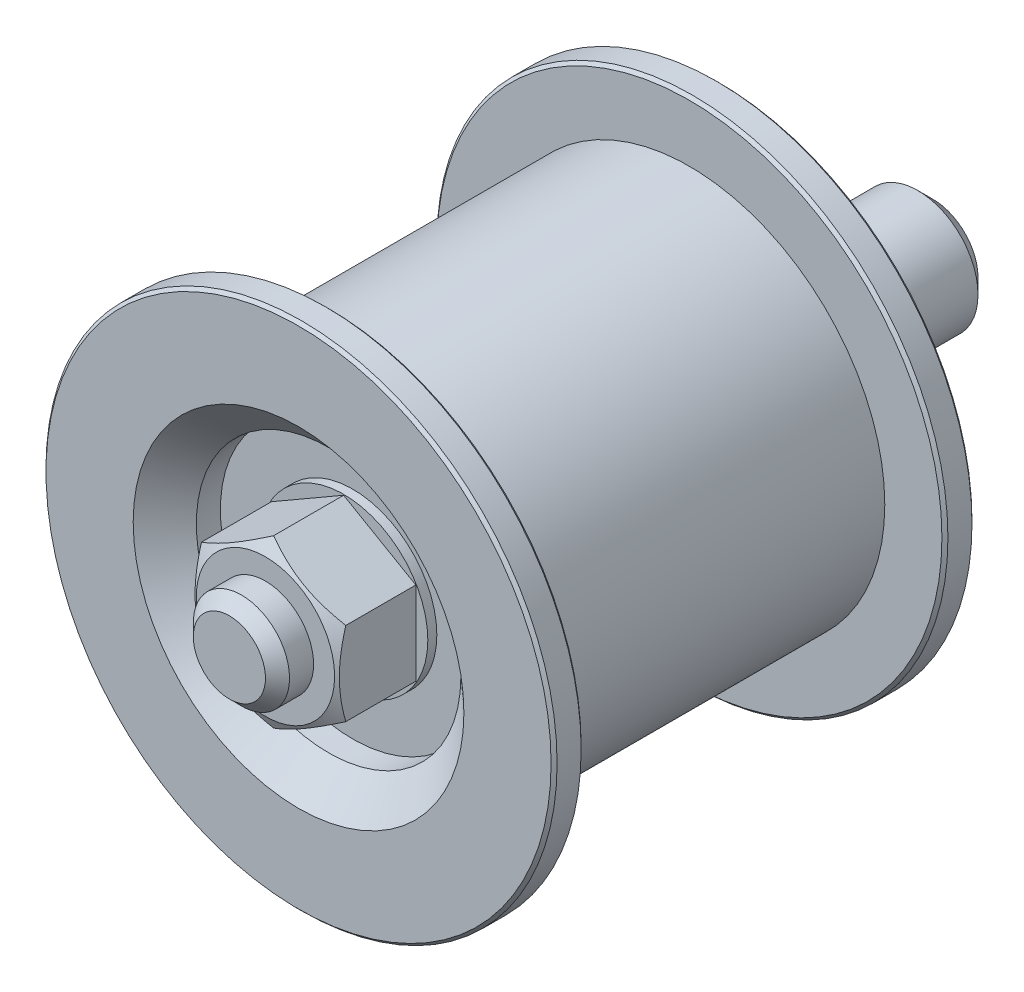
ISO-10303-21;
HEADER;
FILE_DESCRIPTION(('STEP AP214'),'2;1');
FILE_NAME('part.step','',(''),(''),'','','');
FILE_SCHEMA(('AUTOMOTIVE_DESIGN { 1 0 10303 214 1 1 1 1 }'));
ENDSEC;
DATA;
#1=APPLICATION_CONTEXT('core data for automotive mechanical design processes');
#2=APPLICATION_PROTOCOL_DEFINITION('international standard','automotive_design',2000,#1);
#3=PRODUCT_CONTEXT('',#1,'mechanical');
#4=PRODUCT('Part','Part','',(#3));
#5=PRODUCT_RELATED_PRODUCT_CATEGORY('part','',(#4));
#6=PRODUCT_DEFINITION_FORMATION('','',#4);
#7=PRODUCT_DEFINITION_CONTEXT('part definition',#1,'design');
#8=PRODUCT_DEFINITION('design','',#6,#7);
#9=PRODUCT_DEFINITION_SHAPE('','',#8);
#10=(LENGTH_UNIT() NAMED_UNIT(*) SI_UNIT(.MILLI.,.METRE.));
#11=(NAMED_UNIT(*) PLANE_ANGLE_UNIT() SI_UNIT($,.RADIAN.));
#12=(NAMED_UNIT(*) SI_UNIT($,.STERADIAN.) SOLID_ANGLE_UNIT());
#13=UNCERTAINTY_MEASURE_WITH_UNIT(LENGTH_MEASURE(1.E-05),#10,'distance_accuracy_value','');
#14=(GEOMETRIC_REPRESENTATION_CONTEXT(3) GLOBAL_UNCERTAINTY_ASSIGNED_CONTEXT((#13)) GLOBAL_UNIT_ASSIGNED_CONTEXT((#10,
#11,#12)) REPRESENTATION_CONTEXT('',''));
#15=CARTESIAN_POINT('',(0.,0.,0.));
#16=DIRECTION('',(0.,0.,1.));
#17=DIRECTION('',(1.,0.,0.));
#18=AXIS2_PLACEMENT_3D('',#15,#16,#17);
#19=CARTESIAN_POINT('',(-12.,-6.92820323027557,125.160605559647));
#20=DIRECTION('',(0.5,0.866025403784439,0.));
#21=DIRECTION('',(-0.866025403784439,0.5,0.));
#22=AXIS2_PLACEMENT_3D('',#19,#20,#21);
#23=PLANE('',#22);
#24=CARTESIAN_POINT('',(-12.0002,-6.92808776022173,87.1394614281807));
#25=CARTESIAN_POINT('',(-11.7364142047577,-7.08038456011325,87.2273752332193));
#26=CARTESIAN_POINT('',(-11.4716448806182,-7.23324920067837,87.3112988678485));
#27=CARTESIAN_POINT('',(-10.9399829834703,-7.54020434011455,87.4700586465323));
#28=CARTESIAN_POINT('',(-10.6730897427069,-7.6942952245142,87.5448918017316));
#29=CARTESIAN_POINT('',(-9.868109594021,-8.15905073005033,87.754307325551));
#30=CARTESIAN_POINT('',(-9.32684492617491,-8.4715500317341,87.8734216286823));
#31=CARTESIAN_POINT('',(-8.51686717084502,-8.93919090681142,88.013093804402));
#32=CARTESIAN_POINT('',(-8.25057389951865,-9.09293539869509,88.0528810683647));
#33=CARTESIAN_POINT('',(-7.71675440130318,-9.40113622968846,88.1196014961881));
#34=CARTESIAN_POINT('',(-7.44922815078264,-9.55559258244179,88.1465344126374));
#35=CARTESIAN_POINT('',(-6.91372963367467,-9.86476279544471,88.1868562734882));
#36=CARTESIAN_POINT('',(-6.64575827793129,-10.0194761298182,88.2002613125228));
#37=CARTESIAN_POINT('',(-6.10956726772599,-10.3290461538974,88.213241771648));
#38=CARTESIAN_POINT('',(-5.84134762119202,-10.4839028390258,88.2128176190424));
#39=CARTESIAN_POINT('',(-5.33991062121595,-10.7734076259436,88.1991048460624));
#40=CARTESIAN_POINT('',(-5.10665750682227,-10.908076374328,88.1874888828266));
#41=CARTESIAN_POINT('',(-4.64068775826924,-11.1771041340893,88.1540168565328));
#42=CARTESIAN_POINT('',(-4.40797116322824,-11.3114631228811,88.1321600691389));
#43=CARTESIAN_POINT('',(-3.94320092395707,-11.5797983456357,88.0785874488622));
#44=CARTESIAN_POINT('',(-3.71114798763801,-11.7137741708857,88.0468634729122));
#45=CARTESIAN_POINT('',(-3.24813003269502,-11.9810977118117,87.9741130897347));
#46=CARTESIAN_POINT('',(-3.01716508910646,-12.1144453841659,87.933086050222));
#47=CARTESIAN_POINT('',(-2.31605804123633,-12.5192297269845,87.7950132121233));
#48=CARTESIAN_POINT('',(-1.84794625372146,-12.789494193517,87.6841999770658));
#49=CARTESIAN_POINT('',(-0.918702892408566,-13.3259930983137,87.4326990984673));
#50=CARTESIAN_POINT('',(-0.457559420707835,-13.5922344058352,87.2920705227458));
#51=CARTESIAN_POINT('',(0.000199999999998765,-13.856521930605,87.1394614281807));
#52=B_SPLINE_CURVE_WITH_KNOTS('',3,(#24,#25,#26,#27,#28,#29,#30,#31,#32,#33,#34,#35,#36,#37,#38,
#39,#40,#41,#42,#43,#44,#45,#46,#47,#48,#49,#50,#51),.UNSPECIFIED.,.F.,.F.,(4,2,2,2,2,2,2,2,2,2,
2,2,2,4),(0.,0.951004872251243,1.90232158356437,3.80900466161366,4.73894551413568,
5.66890426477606,6.59775529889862,7.52657763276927,8.33514643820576,9.14377244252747,
9.95306755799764,10.7624176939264,12.4167102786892,14.0677556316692),.UNSPECIFIED.);
#53=CARTESIAN_POINT('',(-12.,-6.92820323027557,87.1395280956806));
#54=VERTEX_POINT('',#53);
#55=CARTESIAN_POINT('',(0.,-13.8564064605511,87.1395280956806));
#56=VERTEX_POINT('',#55);
#57=EDGE_CURVE('E93',#54,#56,#52,.T.);
#58=ORIENTED_EDGE('',*,*,#57,.F.);
#59=DIRECTION('',(0.,0.,-1.));
#60=VECTOR('',#59,1.);
#61=CARTESIAN_POINT('',(-12.,-6.92820323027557,125.160605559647));
#62=LINE('',#61,#60);
#63=CARTESIAN_POINT('',(-12.,-6.92820323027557,75.5));
#64=VERTEX_POINT('',#63);
#65=EDGE_CURVE('E101',#54,#64,#62,.T.);
#66=ORIENTED_EDGE('',*,*,#65,.T.);
#67=DIRECTION('',(0.866025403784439,-0.5,0.));
#68=VECTOR('',#67,1.);
#69=CARTESIAN_POINT('',(-12.,-6.92820323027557,75.5));
#70=LINE('',#69,#68);
#71=CARTESIAN_POINT('',(0.,-13.8564064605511,75.5));
#72=VERTEX_POINT('',#71);
#73=EDGE_CURVE('E109',#64,#72,#70,.T.);
#74=ORIENTED_EDGE('',*,*,#73,.T.);
#75=DIRECTION('',(0.,0.,-1.));
#76=VECTOR('',#75,1.);
#77=CARTESIAN_POINT('',(0.,-13.8564064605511,125.160605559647));
#78=LINE('',#77,#76);
#79=EDGE_CURVE('E102',#56,#72,#78,.T.);
#80=ORIENTED_EDGE('',*,*,#79,.F.);
#81=EDGE_LOOP('',(#58,#66,#74,#80));
#82=FACE_BOUND('',#81,.T.);
#83=ADVANCED_FACE('F15',(#82),#23,.F.);
#84=CARTESIAN_POINT('',(0.,-13.8564064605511,125.160605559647));
#85=DIRECTION('',(-0.5,0.866025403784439,0.));
#86=DIRECTION('',(-0.866025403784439,-0.5,0.));
#87=AXIS2_PLACEMENT_3D('',#84,#85,#86);
#88=PLANE('',#87);
#89=CARTESIAN_POINT('',(-0.000200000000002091,-13.856521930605,87.1394614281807));
#90=CARTESIAN_POINT('',(0.26358579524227,-13.7042251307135,87.2273752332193));
#91=CARTESIAN_POINT('',(0.528355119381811,-13.5513604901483,87.3112988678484));
#92=CARTESIAN_POINT('',(1.06001701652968,-13.2444053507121,87.4700586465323));
#93=CARTESIAN_POINT('',(1.32691025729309,-13.0903144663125,87.5448918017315));
#94=CARTESIAN_POINT('',(2.13189040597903,-12.6255589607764,87.754307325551));
#95=CARTESIAN_POINT('',(2.67315507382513,-12.3130596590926,87.8734216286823));
#96=CARTESIAN_POINT('',(3.48313282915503,-11.8454187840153,88.013093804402));
#97=CARTESIAN_POINT('',(3.74942610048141,-11.6916742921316,88.0528810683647));
#98=CARTESIAN_POINT('',(4.28324559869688,-11.3834734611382,88.119601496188));
#99=CARTESIAN_POINT('',(4.55077184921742,-11.2290171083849,88.1465344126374));
#100=CARTESIAN_POINT('',(5.08627036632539,-10.919846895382,88.1868562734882));
#101=CARTESIAN_POINT('',(5.35424172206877,-10.7651335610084,88.2002613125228));
#102=CARTESIAN_POINT('',(5.89043273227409,-10.4555635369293,88.213241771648));
#103=CARTESIAN_POINT('',(6.15865237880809,-10.300706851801,88.2128176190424));
#104=CARTESIAN_POINT('',(6.66008937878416,-10.0112020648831,88.1991048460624));
#105=CARTESIAN_POINT('',(6.89334249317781,-9.87653331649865,88.1874888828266));
#106=CARTESIAN_POINT('',(7.35931224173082,-9.60750555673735,88.1540168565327));
#107=CARTESIAN_POINT('',(7.59202883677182,-9.47314656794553,88.1321600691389));
#108=CARTESIAN_POINT('',(8.05679907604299,-9.20481134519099,88.0785874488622));
#109=CARTESIAN_POINT('',(8.28885201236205,-9.07083551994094,88.0468634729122));
#110=CARTESIAN_POINT('',(8.75186996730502,-8.80351197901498,87.9741130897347));
#111=CARTESIAN_POINT('',(8.98283491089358,-8.67016430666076,87.9330860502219));
#112=CARTESIAN_POINT('',(9.68394195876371,-8.26537996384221,87.7950132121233));
#113=CARTESIAN_POINT('',(10.1520537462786,-7.99511549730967,87.6841999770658));
#114=CARTESIAN_POINT('',(11.0812971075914,-7.45861659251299,87.4326990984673));
#115=CARTESIAN_POINT('',(11.5424405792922,-7.19237528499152,87.2920705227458));
#116=CARTESIAN_POINT('',(12.0002,-6.92808776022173,87.1394614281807));
#117=B_SPLINE_CURVE_WITH_KNOTS('',3,(#89,#90,#91,#92,#93,#94,#95,#96,#97,#98,#99,#100,#101,#102,
#103,#104,#105,#106,#107,#108,#109,#110,#111,#112,#113,#114,#115,#116),.UNSPECIFIED.,.F.,.F.,(4,
2,2,2,2,2,2,2,2,2,2,2,2,4),(0.,0.951004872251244,1.90232158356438,3.8090046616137,
4.73894551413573,5.66890426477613,6.59775529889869,7.52657763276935,8.33514643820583,
9.14377244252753,9.95306755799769,10.7624176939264,12.4167102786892,14.0677556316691),.UNSPECIFIED.);
#118=CARTESIAN_POINT('',(12.,-6.92820323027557,87.1395280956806));
#119=VERTEX_POINT('',#118);
#120=EDGE_CURVE('E103',#56,#119,#117,.T.);
#121=ORIENTED_EDGE('',*,*,#120,.F.);
#122=ORIENTED_EDGE('',*,*,#79,.T.);
#123=DIRECTION('',(0.866025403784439,0.5,0.));
#124=VECTOR('',#123,1.);
#125=CARTESIAN_POINT('',(0.,-13.8564064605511,75.5));
#126=LINE('',#125,#124);
#127=CARTESIAN_POINT('',(12.,-6.92820323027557,75.5));
#128=VERTEX_POINT('',#127);
#129=EDGE_CURVE('E368',#72,#128,#126,.T.);
#130=ORIENTED_EDGE('',*,*,#129,.T.);
#131=DIRECTION('',(0.,0.,-1.));
#132=VECTOR('',#131,1.);
#133=CARTESIAN_POINT('',(12.,-6.92820323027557,125.160605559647));
#134=LINE('',#133,#132);
#135=EDGE_CURVE('E366',#119,#128,#134,.T.);
#136=ORIENTED_EDGE('',*,*,#135,.F.);
#137=EDGE_LOOP('',(#121,#122,#130,#136));
#138=FACE_BOUND('',#137,.T.);
#139=ADVANCED_FACE('F275',(#138),#88,.F.);
#140=CARTESIAN_POINT('',(12.,-6.92820323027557,125.160605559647));
#141=DIRECTION('',(-1.,0.,0.));
#142=DIRECTION('',(0.,-1.,0.));
#143=AXIS2_PLACEMENT_3D('',#140,#141,#142);
#144=PLANE('',#143);
#145=CARTESIAN_POINT('',(12.,-18.5111420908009,82.4029353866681));
#146=CARTESIAN_POINT('',(12.,-18.2495002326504,82.5296880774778));
#147=CARTESIAN_POINT('',(12.,-17.9875486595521,82.6558011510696));
#148=CARTESIAN_POINT('',(12.,-17.4629614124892,82.9066029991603));
#149=CARTESIAN_POINT('',(12.,-17.2003257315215,83.0312917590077));
#150=CARTESIAN_POINT('',(12.,-16.4112241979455,83.4030374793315));
#151=CARTESIAN_POINT('',(12.,-15.88364280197,83.6477355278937));
#152=CARTESIAN_POINT('',(12.,-14.8219973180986,84.1306811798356));
#153=CARTESIAN_POINT('',(12.,-14.2879135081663,84.3688855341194));
#154=CARTESIAN_POINT('',(12.,-13.21546367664,84.835416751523));
#155=CARTESIAN_POINT('',(12.,-12.6770978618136,85.063744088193));
#156=CARTESIAN_POINT('',(12.,-11.5782458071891,85.5148760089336));
#157=CARTESIAN_POINT('',(12.,-11.017595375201,85.7372827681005));
#158=CARTESIAN_POINT('',(12.,-9.88969485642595,86.165023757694));
#159=CARTESIAN_POINT('',(12.,-9.3224440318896,86.3703560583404));
#160=CARTESIAN_POINT('',(12.,-8.18155310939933,86.7584822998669));
#161=CARTESIAN_POINT('',(12.,-7.60792895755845,86.941322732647));
#162=CARTESIAN_POINT('',(12.,-6.4523986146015,87.2785428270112));
#163=CARTESIAN_POINT('',(12.,-5.87049512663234,87.4329315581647));
#164=CARTESIAN_POINT('',(12.,-4.99293798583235,87.6371211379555));
#165=CARTESIAN_POINT('',(12.,-4.70042056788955,87.7004860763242));
#166=CARTESIAN_POINT('',(12.,-4.11340579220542,87.8173197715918));
#167=CARTESIAN_POINT('',(12.,-3.81890847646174,87.8707887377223));
#168=CARTESIAN_POINT('',(12.,-3.22814372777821,87.9668808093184));
#169=CARTESIAN_POINT('',(12.,-2.93187631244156,88.0095040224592));
#170=CARTESIAN_POINT('',(12.,-2.33789395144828,88.0830506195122));
#171=CARTESIAN_POINT('',(12.,-2.04017906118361,88.1139744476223));
#172=CARTESIAN_POINT('',(12.,-1.44756141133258,88.1631257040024));
#173=CARTESIAN_POINT('',(12.,-1.15267188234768,88.1815116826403));
#174=CARTESIAN_POINT('',(12.,-0.562380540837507,88.2058034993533));
#175=CARTESIAN_POINT('',(12.,-0.266978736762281,88.2117095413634));
#176=CARTESIAN_POINT('',(12.,0.323811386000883,88.2109013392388));
#177=CARTESIAN_POINT('',(12.,0.619199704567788,88.2041869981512));
#178=CARTESIAN_POINT('',(12.,1.20943354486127,88.1783000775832));
#179=CARTESIAN_POINT('',(12.,1.50427904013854,88.1591269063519));
#180=CARTESIAN_POINT('',(12.,2.21590045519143,88.0982192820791));
#181=CARTESIAN_POINT('',(12.,2.63216502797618,88.0504062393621));
#182=CARTESIAN_POINT('',(12.,3.46154175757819,87.9325751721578));
#183=CARTESIAN_POINT('',(12.,3.87465346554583,87.8625540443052));
#184=CARTESIAN_POINT('',(12.,4.69735211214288,87.702797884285));
#185=CARTESIAN_POINT('',(12.,5.10693598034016,87.6130471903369));
#186=CARTESIAN_POINT('',(12.,5.92196451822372,87.4165647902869));
#187=CARTESIAN_POINT('',(12.,6.32740925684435,87.3098333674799));
#188=CARTESIAN_POINT('',(12.,7.14302753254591,87.0794713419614));
#189=CARTESIAN_POINT('',(12.,7.55311044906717,86.9555220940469));
#190=CARTESIAN_POINT('',(12.,8.36923544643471,86.6950334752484));
#191=CARTESIAN_POINT('',(12.,8.77527750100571,86.5584940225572));
#192=CARTESIAN_POINT('',(12.,9.58352534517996,86.274973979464));
#193=CARTESIAN_POINT('',(12.,9.98573240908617,86.1279970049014));
#194=CARTESIAN_POINT('',(12.,10.7868281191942,85.8253098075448));
#195=CARTESIAN_POINT('',(12.,11.1857168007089,85.6695996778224));
#196=CARTESIAN_POINT('',(12.,12.112392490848,85.2980366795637));
#197=CARTESIAN_POINT('',(12.,12.6390479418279,85.0793662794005));
#198=CARTESIAN_POINT('',(12.,13.6880095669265,84.6318026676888));
#199=CARTESIAN_POINT('',(12.,14.2103154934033,84.4029088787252));
#200=CARTESIAN_POINT('',(12.,15.2513695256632,83.9369063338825));
#201=CARTESIAN_POINT('',(12.,15.7701168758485,83.6997958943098));
#202=CARTESIAN_POINT('',(12.,16.8045284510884,83.2189840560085));
#203=CARTESIAN_POINT('',(12.,17.3201927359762,82.9752827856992));
#204=CARTESIAN_POINT('',(12.,18.3494699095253,82.4822448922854));
#205=CARTESIAN_POINT('',(12.,18.8630801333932,82.2329027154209));
#206=CARTESIAN_POINT('',(12.,19.8881188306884,81.7297744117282));
#207=CARTESIAN_POINT('',(12.,20.3995472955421,81.4759882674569));
#208=CARTESIAN_POINT('',(12.,21.4204911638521,80.9647513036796));
#209=CARTESIAN_POINT('',(12.,21.9300067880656,80.7073009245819));
#210=CARTESIAN_POINT('',(12.,22.947458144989,80.189295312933));
#211=CARTESIAN_POINT('',(12.,23.4553938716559,79.9287400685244));
#212=CARTESIAN_POINT('',(12.,24.8945607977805,79.1857987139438));
#213=CARTESIAN_POINT('',(12.,25.8241883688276,78.7003061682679));
#214=CARTESIAN_POINT('',(12.,27.6799854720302,77.7226987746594));
#215=CARTESIAN_POINT('',(12.,28.6061548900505,77.2305837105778));
#216=CARTESIAN_POINT('',(12.,30.4535876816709,76.2424349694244));
#217=CARTESIAN_POINT('',(12.,31.3748574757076,75.7464132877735));
#218=CARTESIAN_POINT('',(12.,32.7551237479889,74.9994140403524));
#219=CARTESIAN_POINT('',(12.,33.2149276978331,74.7499262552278));
#220=CARTESIAN_POINT('',(12.,34.1340503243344,74.2500600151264));
#221=CARTESIAN_POINT('',(12.,34.5933690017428,73.9996815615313));
#222=CARTESIAN_POINT('',(12.,35.052472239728,73.7489085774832));
#223=B_SPLINE_CURVE_WITH_KNOTS('',3,(#145,#146,#147,#148,#149,#150,#151,#152,#153,#154,#155,
#156,#157,#158,#159,#160,#161,#162,#163,#164,#165,#166,#167,#168,#169,#170,#171,#172,#173,#174,
#175,#176,#177,#178,#179,#180,#181,#182,#183,#184,#185,#186,#187,#188,#189,#190,#191,#192,#193,
#194,#195,#196,#197,#198,#199,#200,#201,#202,#203,#204,#205,#206,#207,#208,#209,#210,#211,#212,
#213,#214,#215,#216,#217,#218,#219,#220,#221,#222),.UNSPECIFIED.,.F.,.F.,(4,2,2,2,2,2,2,2,2,2,2,
2,2,2,2,2,2,2,2,2,2,2,2,2,2,2,2,2,2,2,2,2,2,2,2,2,2,2,4),(0.,0.872182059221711,1.74437308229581,
3.48901842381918,5.2433297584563,6.99755688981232,8.80680391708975,10.6162551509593,
12.4219009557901,14.2269701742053,15.1247351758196,16.0224811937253,16.9202182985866,
17.8179213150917,18.7040505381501,19.5901652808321,20.4762868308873,21.3624504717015,
22.6187576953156,23.8752405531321,25.1327244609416,26.3901873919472,27.6751622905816,
28.9601455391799,30.2446857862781,31.5292123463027,33.2398111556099,34.9505067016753,
36.6615548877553,38.3725697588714,40.0853496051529,41.7981361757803,43.5107185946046,
45.2233075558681,48.3695657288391,51.515926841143,54.6548592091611,56.22424512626,
57.7936286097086),.UNSPECIFIED.);
#224=CARTESIAN_POINT('',(12.,6.92820323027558,87.1395280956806));
#225=VERTEX_POINT('',#224);
#226=EDGE_CURVE('E332',#119,#225,#223,.T.);
#227=ORIENTED_EDGE('',*,*,#226,.F.);
#228=ORIENTED_EDGE('',*,*,#135,.T.);
#229=DIRECTION('',(0.,1.,0.));
#230=VECTOR('',#229,1.);
#231=CARTESIAN_POINT('',(12.,-6.92820323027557,75.5));
#232=LINE('',#231,#230);
#233=CARTESIAN_POINT('',(12.,6.92820323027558,75.5));
#234=VERTEX_POINT('',#233);
#235=EDGE_CURVE('E365',#128,#234,#232,.T.);
#236=ORIENTED_EDGE('',*,*,#235,.T.);
#237=DIRECTION('',(0.,0.,-1.));
#238=VECTOR('',#237,1.);
#239=CARTESIAN_POINT('',(12.,6.92820323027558,125.160605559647));
#240=LINE('',#239,#238);
#241=EDGE_CURVE('E361',#225,#234,#240,.T.);
#242=ORIENTED_EDGE('',*,*,#241,.F.);
#243=EDGE_LOOP('',(#227,#228,#236,#242));
#244=FACE_BOUND('',#243,.T.);
#245=ADVANCED_FACE('F280',(#244),#144,.F.);
#246=CARTESIAN_POINT('',(12.,6.92820323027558,125.160605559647));
#247=DIRECTION('',(-0.5,-0.866025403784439,0.));
#248=DIRECTION('',(0.866025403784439,-0.5,0.));
#249=AXIS2_PLACEMENT_3D('',#246,#247,#248);
#250=PLANE('',#249);
#251=CARTESIAN_POINT('',(12.0002,6.92808776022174,87.1394614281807));
#252=CARTESIAN_POINT('',(11.7364142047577,7.08038456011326,87.2273752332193));
#253=CARTESIAN_POINT('',(11.4716448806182,7.23324920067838,87.3112988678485));
#254=CARTESIAN_POINT('',(10.9399829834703,7.54020434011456,87.4700586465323));
#255=CARTESIAN_POINT('',(10.6730897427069,7.69429522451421,87.5448918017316));
#256=CARTESIAN_POINT('',(9.868109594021,8.15905073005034,87.754307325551));
#257=CARTESIAN_POINT('',(9.32684492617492,8.47155003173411,87.8734216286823));
#258=CARTESIAN_POINT('',(8.51686717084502,8.93919090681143,88.013093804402));
#259=CARTESIAN_POINT('',(8.25057389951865,9.0929353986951,88.0528810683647));
#260=CARTESIAN_POINT('',(7.71675440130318,9.40113622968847,88.1196014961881));
#261=CARTESIAN_POINT('',(7.44922815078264,9.5555925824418,88.1465344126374));
#262=CARTESIAN_POINT('',(6.91372963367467,9.86476279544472,88.1868562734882));
#263=CARTESIAN_POINT('',(6.64575827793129,10.0194761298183,88.2002613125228));
#264=CARTESIAN_POINT('',(6.109567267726,10.3290461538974,88.213241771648));
#265=CARTESIAN_POINT('',(5.84134762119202,10.4839028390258,88.2128176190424));
#266=CARTESIAN_POINT('',(5.33991062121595,10.7734076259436,88.1991048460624));
#267=CARTESIAN_POINT('',(5.10665750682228,10.908076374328,88.1874888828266));
#268=CARTESIAN_POINT('',(4.64068775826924,11.1771041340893,88.1540168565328));
#269=CARTESIAN_POINT('',(4.40797116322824,11.3114631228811,88.1321600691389));
#270=CARTESIAN_POINT('',(3.94320092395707,11.5797983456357,88.0785874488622));
#271=CARTESIAN_POINT('',(3.71114798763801,11.7137741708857,88.0468634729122));
#272=CARTESIAN_POINT('',(3.24813003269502,11.9810977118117,87.9741130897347));
#273=CARTESIAN_POINT('',(3.01716508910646,12.1144453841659,87.9330860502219));
#274=CARTESIAN_POINT('',(2.31605804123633,12.5192297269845,87.7950132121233));
#275=CARTESIAN_POINT('',(1.84794625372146,12.789494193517,87.6841999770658));
#276=CARTESIAN_POINT('',(0.918702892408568,13.3259930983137,87.4326990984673));
#277=CARTESIAN_POINT('',(0.457559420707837,13.5922344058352,87.2920705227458));
#278=CARTESIAN_POINT('',(-0.000199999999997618,13.856521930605,87.1394614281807));
#279=B_SPLINE_CURVE_WITH_KNOTS('',3,(#251,#252,#253,#254,#255,#256,#257,#258,#259,#260,#261,
#262,#263,#264,#265,#266,#267,#268,#269,#270,#271,#272,#273,#274,#275,#276,#277,#278),
.UNSPECIFIED.,.F.,.F.,(4,2,2,2,2,2,2,2,2,2,2,2,2,4),(0.,0.951004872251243,1.90232158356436,
3.80900466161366,4.73894551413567,5.66890426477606,6.59775529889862,7.52657763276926,
8.33514643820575,9.14377244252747,9.95306755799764,10.7624176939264,12.4167102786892,
14.0677556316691),.UNSPECIFIED.);
#280=CARTESIAN_POINT('',(0.,13.8564064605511,87.1395280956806));
#281=VERTEX_POINT('',#280);
#282=EDGE_CURVE('E326',#225,#281,#279,.T.);
#283=ORIENTED_EDGE('',*,*,#282,.F.);
#284=ORIENTED_EDGE('',*,*,#241,.T.);
#285=DIRECTION('',(-0.866025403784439,0.5,0.));
#286=VECTOR('',#285,1.);
#287=CARTESIAN_POINT('',(12.,6.92820323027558,75.5));
#288=LINE('',#287,#286);
#289=CARTESIAN_POINT('',(0.,13.8564064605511,75.5));
#290=VERTEX_POINT('',#289);
#291=EDGE_CURVE('E358',#234,#290,#288,.T.);
#292=ORIENTED_EDGE('',*,*,#291,.T.);
#293=DIRECTION('',(0.,0.,-1.));
#294=VECTOR('',#293,1.);
#295=CARTESIAN_POINT('',(0.,13.8564064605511,125.160605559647));
#296=LINE('',#295,#294);
#297=EDGE_CURVE('E353',#281,#290,#296,.T.);
#298=ORIENTED_EDGE('',*,*,#297,.F.);
#299=EDGE_LOOP('',(#283,#284,#292,#298));
#300=FACE_BOUND('',#299,.T.);
#301=ADVANCED_FACE('F339',(#300),#250,.F.);
#302=CARTESIAN_POINT('',(0.,13.8564064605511,125.160605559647));
#303=DIRECTION('',(0.5,-0.866025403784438,0.));
#304=DIRECTION('',(0.866025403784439,0.5,0.));
#305=AXIS2_PLACEMENT_3D('',#302,#303,#304);
#306=PLANE('',#305);
#307=CARTESIAN_POINT('',(0.0002,13.856521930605,87.1394614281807));
#308=CARTESIAN_POINT('',(-0.263585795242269,13.7042251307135,87.2273752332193));
#309=CARTESIAN_POINT('',(-0.528355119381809,13.5513604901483,87.3112988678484));
#310=CARTESIAN_POINT('',(-1.06001701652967,13.2444053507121,87.4700586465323));
#311=CARTESIAN_POINT('',(-1.32691025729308,13.0903144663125,87.5448918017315));
#312=CARTESIAN_POINT('',(-2.13189040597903,12.6255589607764,87.754307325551));
#313=CARTESIAN_POINT('',(-2.67315507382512,12.3130596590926,87.8734216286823));
#314=CARTESIAN_POINT('',(-3.48313282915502,11.8454187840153,88.013093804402));
#315=CARTESIAN_POINT('',(-3.7494261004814,11.6916742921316,88.0528810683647));
#316=CARTESIAN_POINT('',(-4.28324559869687,11.3834734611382,88.119601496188));
#317=CARTESIAN_POINT('',(-4.55077184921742,11.2290171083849,88.1465344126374));
#318=CARTESIAN_POINT('',(-5.08627036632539,10.919846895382,88.1868562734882));
#319=CARTESIAN_POINT('',(-5.35424172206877,10.7651335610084,88.2002613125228));
#320=CARTESIAN_POINT('',(-5.89043273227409,10.4555635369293,88.213241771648));
#321=CARTESIAN_POINT('',(-6.15865237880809,10.300706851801,88.2128176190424));
#322=CARTESIAN_POINT('',(-6.66008937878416,10.0112020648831,88.1991048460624));
#323=CARTESIAN_POINT('',(-6.8933424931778,9.87653331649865,88.1874888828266));
#324=CARTESIAN_POINT('',(-7.35931224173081,9.60750555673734,88.1540168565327));
#325=CARTESIAN_POINT('',(-7.59202883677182,9.47314656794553,88.1321600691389));
#326=CARTESIAN_POINT('',(-8.05679907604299,9.20481134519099,88.0785874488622));
#327=CARTESIAN_POINT('',(-8.28885201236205,9.07083551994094,88.0468634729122));
#328=CARTESIAN_POINT('',(-8.75186996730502,8.80351197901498,87.9741130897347));
#329=CARTESIAN_POINT('',(-8.98283491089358,8.67016430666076,87.9330860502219));
#330=CARTESIAN_POINT('',(-9.6839419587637,8.2653799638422,87.7950132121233));
#331=CARTESIAN_POINT('',(-10.1520537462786,7.99511549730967,87.6841999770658));
#332=CARTESIAN_POINT('',(-11.0812971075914,7.45861659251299,87.4326990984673));
#333=CARTESIAN_POINT('',(-11.5424405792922,7.19237528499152,87.2920705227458));
#334=CARTESIAN_POINT('',(-12.0002,6.92808776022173,87.1394614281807));
#335=B_SPLINE_CURVE_WITH_KNOTS('',3,(#307,#308,#309,#310,#311,#312,#313,#314,#315,#316,#317,
#318,#319,#320,#321,#322,#323,#324,#325,#326,#327,#328,#329,#330,#331,#332,#333,#334),
.UNSPECIFIED.,.F.,.F.,(4,2,2,2,2,2,2,2,2,2,2,2,2,4),(0.,0.95100487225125,1.90232158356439,
3.80900466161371,4.73894551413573,5.66890426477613,6.5977552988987,7.52657763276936,
8.33514643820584,9.14377244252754,9.9530675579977,10.7624176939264,12.4167102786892,
14.0677556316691),.UNSPECIFIED.);
#336=CARTESIAN_POINT('',(-12.,6.92820323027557,87.1395280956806));
#337=VERTEX_POINT('',#336);
#338=EDGE_CURVE('E30',#281,#337,#335,.T.);
#339=ORIENTED_EDGE('',*,*,#338,.F.);
#340=ORIENTED_EDGE('',*,*,#297,.T.);
#341=DIRECTION('',(-0.866025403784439,-0.5,0.));
#342=VECTOR('',#341,1.);
#343=CARTESIAN_POINT('',(0.,13.8564064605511,75.5));
#344=LINE('',#343,#342);
#345=CARTESIAN_POINT('',(-12.,6.92820323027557,75.5));
#346=VERTEX_POINT('',#345);
#347=EDGE_CURVE('E360',#290,#346,#344,.T.);
#348=ORIENTED_EDGE('',*,*,#347,.T.);
#349=DIRECTION('',(0.,0.,-1.));
#350=VECTOR('',#349,1.);
#351=CARTESIAN_POINT('',(-12.,6.92820323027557,125.160605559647));
#352=LINE('',#351,#350);
#353=EDGE_CURVE('E37',#337,#346,#352,.T.);
#354=ORIENTED_EDGE('',*,*,#353,.F.);
#355=EDGE_LOOP('',(#339,#340,#348,#354));
#356=FACE_BOUND('',#355,.T.);
#357=ADVANCED_FACE('F343',(#356),#306,.F.);
#358=CARTESIAN_POINT('',(-12.,6.92820323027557,125.160605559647));
#359=DIRECTION('',(1.,0.,0.));
#360=DIRECTION('',(0.,0.,-1.));
#361=AXIS2_PLACEMENT_3D('',#358,#359,#360);
#362=PLANE('',#361);
#363=CARTESIAN_POINT('',(-12.,-18.5111420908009,82.4029353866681));
#364=CARTESIAN_POINT('',(-12.,-18.2495002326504,82.5296880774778));
#365=CARTESIAN_POINT('',(-12.,-17.9875486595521,82.6558011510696));
#366=CARTESIAN_POINT('',(-12.,-17.4629614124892,82.9066029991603));
#367=CARTESIAN_POINT('',(-12.,-17.2003257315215,83.0312917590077));
#368=CARTESIAN_POINT('',(-12.,-16.4112241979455,83.4030374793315));
#369=CARTESIAN_POINT('',(-12.,-15.88364280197,83.6477355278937));
#370=CARTESIAN_POINT('',(-12.,-14.8219973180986,84.1306811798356));
#371=CARTESIAN_POINT('',(-12.,-14.2879135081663,84.3688855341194));
#372=CARTESIAN_POINT('',(-12.,-13.2154636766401,84.835416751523));
#373=CARTESIAN_POINT('',(-12.,-12.6770978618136,85.063744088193));
#374=CARTESIAN_POINT('',(-12.,-11.5782458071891,85.5148760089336));
#375=CARTESIAN_POINT('',(-12.,-11.017595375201,85.7372827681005));
#376=CARTESIAN_POINT('',(-12.,-9.88969485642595,86.165023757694));
#377=CARTESIAN_POINT('',(-12.,-9.32244403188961,86.3703560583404));
#378=CARTESIAN_POINT('',(-12.,-8.18155310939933,86.7584822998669));
#379=CARTESIAN_POINT('',(-12.,-7.60792895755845,86.941322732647));
#380=CARTESIAN_POINT('',(-12.,-6.4523986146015,87.2785428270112));
#381=CARTESIAN_POINT('',(-12.,-5.87049512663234,87.4329315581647));
#382=CARTESIAN_POINT('',(-12.,-4.99293798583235,87.6371211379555));
#383=CARTESIAN_POINT('',(-12.,-4.70042056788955,87.7004860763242));
#384=CARTESIAN_POINT('',(-12.,-4.11340579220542,87.8173197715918));
#385=CARTESIAN_POINT('',(-12.,-3.81890847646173,87.8707887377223));
#386=CARTESIAN_POINT('',(-12.,-3.22814372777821,87.9668808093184));
#387=CARTESIAN_POINT('',(-12.,-2.93187631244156,88.0095040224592));
#388=CARTESIAN_POINT('',(-12.,-2.33789395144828,88.0830506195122));
#389=CARTESIAN_POINT('',(-12.,-2.04017906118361,88.1139744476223));
#390=CARTESIAN_POINT('',(-12.,-1.44756141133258,88.1631257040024));
#391=CARTESIAN_POINT('',(-12.,-1.15267188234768,88.1815116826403));
#392=CARTESIAN_POINT('',(-12.,-0.562380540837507,88.2058034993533));
#393=CARTESIAN_POINT('',(-12.,-0.266978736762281,88.2117095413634));
#394=CARTESIAN_POINT('',(-12.,0.323811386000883,88.2109013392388));
#395=CARTESIAN_POINT('',(-12.,0.619199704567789,88.2041869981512));
#396=CARTESIAN_POINT('',(-12.,1.20943354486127,88.1783000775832));
#397=CARTESIAN_POINT('',(-12.,1.50427904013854,88.1591269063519));
#398=CARTESIAN_POINT('',(-12.,2.21590045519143,88.0982192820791));
#399=CARTESIAN_POINT('',(-12.,2.63216502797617,88.0504062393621));
#400=CARTESIAN_POINT('',(-12.,3.46154175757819,87.9325751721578));
#401=CARTESIAN_POINT('',(-12.,3.87465346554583,87.8625540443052));
#402=CARTESIAN_POINT('',(-12.,4.69735211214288,87.702797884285));
#403=CARTESIAN_POINT('',(-12.,5.10693598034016,87.6130471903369));
#404=CARTESIAN_POINT('',(-12.,5.92196451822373,87.4165647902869));
#405=CARTESIAN_POINT('',(-12.,6.32740925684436,87.3098333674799));
#406=CARTESIAN_POINT('',(-12.,7.14302753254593,87.0794713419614));
#407=CARTESIAN_POINT('',(-12.,7.55311044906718,86.9555220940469));
#408=CARTESIAN_POINT('',(-12.,8.36923544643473,86.6950334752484));
#409=CARTESIAN_POINT('',(-12.,8.77527750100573,86.5584940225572));
#410=CARTESIAN_POINT('',(-12.,9.58352534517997,86.274973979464));
#411=CARTESIAN_POINT('',(-12.,9.98573240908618,86.1279970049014));
#412=CARTESIAN_POINT('',(-12.,10.7868281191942,85.8253098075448));
#413=CARTESIAN_POINT('',(-12.,11.1857168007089,85.6695996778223));
#414=CARTESIAN_POINT('',(-12.,12.112392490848,85.2980366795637));
#415=CARTESIAN_POINT('',(-12.,12.6390479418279,85.0793662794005));
#416=CARTESIAN_POINT('',(-12.,13.6880095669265,84.6318026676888));
#417=CARTESIAN_POINT('',(-12.,14.2103154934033,84.4029088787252));
#418=CARTESIAN_POINT('',(-12.,15.2513695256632,83.9369063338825));
#419=CARTESIAN_POINT('',(-12.,15.7701168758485,83.6997958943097));
#420=CARTESIAN_POINT('',(-12.,16.8045284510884,83.2189840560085));
#421=CARTESIAN_POINT('',(-12.,17.3201927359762,82.9752827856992));
#422=CARTESIAN_POINT('',(-12.,18.3494699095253,82.4822448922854));
#423=CARTESIAN_POINT('',(-12.,18.8630801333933,82.2329027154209));
#424=CARTESIAN_POINT('',(-12.,19.8881188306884,81.7297744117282));
#425=CARTESIAN_POINT('',(-12.,20.3995472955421,81.4759882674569));
#426=CARTESIAN_POINT('',(-12.,21.4204911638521,80.9647513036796));
#427=CARTESIAN_POINT('',(-12.,21.9300067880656,80.7073009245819));
#428=CARTESIAN_POINT('',(-12.,22.947458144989,80.189295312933));
#429=CARTESIAN_POINT('',(-12.,23.4553938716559,79.9287400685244));
#430=CARTESIAN_POINT('',(-12.,24.8945607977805,79.1857987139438));
#431=CARTESIAN_POINT('',(-12.,25.8241883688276,78.7003061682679));
#432=CARTESIAN_POINT('',(-12.,27.6799854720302,77.7226987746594));
#433=CARTESIAN_POINT('',(-12.,28.6061548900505,77.2305837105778));
#434=CARTESIAN_POINT('',(-12.,30.4535876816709,76.2424349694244));
#435=CARTESIAN_POINT('',(-12.,31.3748574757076,75.7464132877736));
#436=CARTESIAN_POINT('',(-12.,32.7551237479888,74.9994140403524));
#437=CARTESIAN_POINT('',(-12.,33.2149276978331,74.7499262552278));
#438=CARTESIAN_POINT('',(-12.,34.1340503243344,74.2500600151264));
#439=CARTESIAN_POINT('',(-12.,34.5933690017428,73.9996815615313));
#440=CARTESIAN_POINT('',(-12.,35.052472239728,73.7489085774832));
#441=B_SPLINE_CURVE_WITH_KNOTS('',3,(#363,#364,#365,#366,#367,#368,#369,#370,#371,#372,#373,
#374,#375,#376,#377,#378,#379,#380,#381,#382,#383,#384,#385,#386,#387,#388,#389,#390,#391,#392,
#393,#394,#395,#396,#397,#398,#399,#400,#401,#402,#403,#404,#405,#406,#407,#408,#409,#410,#411,
#412,#413,#414,#415,#416,#417,#418,#419,#420,#421,#422,#423,#424,#425,#426,#427,#428,#429,#430,
#431,#432,#433,#434,#435,#436,#437,#438,#439,#440),.UNSPECIFIED.,.F.,.F.,(4,2,2,2,2,2,2,2,2,2,2,
2,2,2,2,2,2,2,2,2,2,2,2,2,2,2,2,2,2,2,2,2,2,2,2,2,2,2,4),(0.,0.872182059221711,1.74437308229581,
3.48901842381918,5.2433297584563,6.99755688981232,8.80680391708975,10.6162551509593,
12.4219009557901,14.2269701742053,15.1247351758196,16.0224811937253,16.9202182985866,
17.8179213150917,18.7040505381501,19.5901652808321,20.4762868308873,21.3624504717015,
22.6187576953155,23.8752405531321,25.1327244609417,26.3901873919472,27.6751622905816,
28.96014553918,30.2446857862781,31.5292123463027,33.2398111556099,34.9505067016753,
36.6615548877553,38.3725697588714,40.0853496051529,41.7981361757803,43.5107185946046,
45.2233075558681,48.3695657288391,51.515926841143,54.6548592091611,56.22424512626,
57.7936286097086),.UNSPECIFIED.);
#442=EDGE_CURVE('E90',#337,#54,#441,.F.);
#443=ORIENTED_EDGE('',*,*,#442,.F.);
#444=ORIENTED_EDGE('',*,*,#353,.T.);
#445=DIRECTION('',(0.,-1.,0.));
#446=VECTOR('',#445,1.);
#447=CARTESIAN_POINT('',(-12.,6.92820323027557,75.5));
#448=LINE('',#447,#446);
#449=EDGE_CURVE('E107',#346,#64,#448,.T.);
#450=ORIENTED_EDGE('',*,*,#449,.T.);
#451=ORIENTED_EDGE('',*,*,#65,.F.);
#452=EDGE_LOOP('',(#443,#444,#450,#451));
#453=FACE_BOUND('',#452,.T.);
#454=ADVANCED_FACE('F105',(#453),#362,.F.);
#455=CARTESIAN_POINT('',(0.,0.,75.5));
#456=DIRECTION('',(0.,0.,1.));
#457=DIRECTION('',(1.,0.,0.));
#458=AXIS2_PLACEMENT_3D('',#455,#456,#457);
#459=PLANE('',#458);
#460=CARTESIAN_POINT('',(0.,0.,75.5));
#461=DIRECTION('',(0.,0.,1.));
#462=DIRECTION('',(1.,0.,0.));
#463=AXIS2_PLACEMENT_3D('',#460,#461,#462);
#464=CIRCLE('',#463,14.);
#465=CARTESIAN_POINT('',(14.,0.,75.5));
#466=VERTEX_POINT('',#465);
#467=EDGE_CURVE('E131',#466,#466,#464,.T.);
#468=ORIENTED_EDGE('',*,*,#467,.T.);
#469=EDGE_LOOP('',(#468));
#470=FACE_BOUND('',#469,.T.);
#471=ORIENTED_EDGE('',*,*,#129,.F.);
#472=ORIENTED_EDGE('',*,*,#73,.F.);
#473=ORIENTED_EDGE('',*,*,#449,.F.);
#474=ORIENTED_EDGE('',*,*,#347,.F.);
#475=ORIENTED_EDGE('',*,*,#291,.F.);
#476=ORIENTED_EDGE('',*,*,#235,.F.);
#477=EDGE_LOOP('',(#471,#472,#473,#474,#475,#476));
#478=FACE_BOUND('',#477,.T.);
#479=ADVANCED_FACE('F351',(#470,#478),#459,.T.);
#480=CARTESIAN_POINT('',(0.,-10.,74.));
#481=DIRECTION('',(0.,0.,-1.));
#482=DIRECTION('',(1.,0.,0.));
#483=AXIS2_PLACEMENT_3D('',#480,#481,#482);
#484=PLANE('',#483);
#485=CARTESIAN_POINT('',(0.,0.,74.));
#486=DIRECTION('',(0.,0.,-1.));
#487=DIRECTION('',(1.,0.,0.));
#488=AXIS2_PLACEMENT_3D('',#485,#486,#487);
#489=CIRCLE('',#488,22.);
#490=CARTESIAN_POINT('',(22.,0.,74.));
#491=VERTEX_POINT('',#490);
#492=EDGE_CURVE('E142',#491,#491,#489,.T.);
#493=ORIENTED_EDGE('',*,*,#492,.F.);
#494=EDGE_LOOP('',(#493));
#495=FACE_BOUND('',#494,.T.);
#496=CARTESIAN_POINT('',(0.,0.,74.));
#497=DIRECTION('',(0.,0.,1.));
#498=DIRECTION('',(1.,0.,0.));
#499=AXIS2_PLACEMENT_3D('',#496,#497,#498);
#500=CIRCLE('',#499,14.);
#501=CARTESIAN_POINT('',(14.,0.,74.));
#502=VERTEX_POINT('',#501);
#503=EDGE_CURVE('E126',#502,#502,#500,.T.);
#504=ORIENTED_EDGE('',*,*,#503,.F.);
#505=EDGE_LOOP('',(#504));
#506=FACE_BOUND('',#505,.T.);
#507=ADVANCED_FACE('F379',(#495,#506),#484,.F.);
#508=CARTESIAN_POINT('',(0.,0.,28.0000000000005));
#509=DIRECTION('',(0.,0.,-1.));
#510=DIRECTION('',(1.,0.,0.));
#511=AXIS2_PLACEMENT_3D('',#508,#509,#510);
#512=CYLINDRICAL_SURFACE('',#511,22.);
#513=CARTESIAN_POINT('',(0.,0.,78.));
#514=DIRECTION('',(0.,0.,-1.));
#515=DIRECTION('',(1.,0.,0.));
#516=AXIS2_PLACEMENT_3D('',#513,#514,#515);
#517=CIRCLE('',#516,22.);
#518=CARTESIAN_POINT('',(22.,0.,78.));
#519=VERTEX_POINT('',#518);
#520=EDGE_CURVE('E195',#519,#519,#517,.T.);
#521=ORIENTED_EDGE('',*,*,#520,.F.);
#522=EDGE_LOOP('',(#521));
#523=FACE_BOUND('',#522,.T.);
#524=ORIENTED_EDGE('',*,*,#492,.T.);
#525=EDGE_LOOP('',(#524));
#526=FACE_BOUND('',#525,.T.);
#527=ADVANCED_FACE('F386',(#523,#526),#512,.F.);
#528=CARTESIAN_POINT('',(0.,0.,78.));
#529=DIRECTION('',(0.,0.,1.));
#530=DIRECTION('',(-1.,0.,0.));
#531=AXIS2_PLACEMENT_3D('',#528,#529,#530);
#532=CONICAL_SURFACE('',#531,22.,0.832981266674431);
#533=CARTESIAN_POINT('',(0.,0.,83.));
#534=DIRECTION('',(0.,0.,-1.));
#535=DIRECTION('',(1.,0.,0.));
#536=AXIS2_PLACEMENT_3D('',#533,#534,#535);
#537=CIRCLE('',#536,27.5);
#538=CARTESIAN_POINT('',(27.5,0.,83.));
#539=VERTEX_POINT('',#538);
#540=EDGE_CURVE('E192',#539,#539,#537,.T.);
#541=ORIENTED_EDGE('',*,*,#540,.F.);
#542=EDGE_LOOP('',(#541));
#543=FACE_BOUND('',#542,.T.);
#544=ORIENTED_EDGE('',*,*,#520,.T.);
#545=EDGE_LOOP('',(#544));
#546=FACE_BOUND('',#545,.T.);
#547=ADVANCED_FACE('F492',(#543,#546),#532,.F.);
#548=CARTESIAN_POINT('',(0.,-42.5,83.));
#549=DIRECTION('',(0.,0.,1.));
#550=DIRECTION('',(-1.,0.,0.));
#551=AXIS2_PLACEMENT_3D('',#548,#549,#550);
#552=PLANE('',#551);
#553=CARTESIAN_POINT('',(0.,0.,83.));
#554=DIRECTION('',(0.,0.,1.));
#555=DIRECTION('',(1.,0.,0.));
#556=AXIS2_PLACEMENT_3D('',#553,#554,#555);
#557=CIRCLE('',#556,42.);
#558=CARTESIAN_POINT('',(42.,0.,83.));
#559=VERTEX_POINT('',#558);
#560=EDGE_CURVE('E23',#559,#559,#557,.T.);
#561=ORIENTED_EDGE('',*,*,#560,.T.);
#562=EDGE_LOOP('',(#561));
#563=FACE_BOUND('',#562,.T.);
#564=ORIENTED_EDGE('',*,*,#540,.T.);
#565=EDGE_LOOP('',(#564));
#566=FACE_BOUND('',#565,.T.);
#567=ADVANCED_FACE('F231',(#563,#566),#552,.T.);
#568=CARTESIAN_POINT('',(0.,0.,28.0000000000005));
#569=DIRECTION('',(0.,0.,-1.));
#570=DIRECTION('',(1.,0.,0.));
#571=AXIS2_PLACEMENT_3D('',#568,#569,#570);
#572=CYLINDRICAL_SURFACE('',#571,42.5);
#573=CARTESIAN_POINT('',(0.,0.,82.5));
#574=DIRECTION('',(0.,0.,1.));
#575=DIRECTION('',(1.,0.,0.));
#576=AXIS2_PLACEMENT_3D('',#573,#574,#575);
#577=CIRCLE('',#576,42.5);
#578=CARTESIAN_POINT('',(42.5,0.,82.5));
#579=VERTEX_POINT('',#578);
#580=EDGE_CURVE('E226',#579,#579,#577,.F.);
#581=ORIENTED_EDGE('',*,*,#580,.T.);
#582=EDGE_LOOP('',(#581));
#583=FACE_BOUND('',#582,.T.);
#584=CARTESIAN_POINT('',(0.,0.,78.5));
#585=DIRECTION('',(0.,0.,1.));
#586=DIRECTION('',(1.,0.,0.));
#587=AXIS2_PLACEMENT_3D('',#584,#585,#586);
#588=CIRCLE('',#587,42.5);
#589=CARTESIAN_POINT('',(42.5,0.,78.5));
#590=VERTEX_POINT('',#589);
#591=EDGE_CURVE('E223',#590,#590,#588,.T.);
#592=ORIENTED_EDGE('',*,*,#591,.T.);
#593=EDGE_LOOP('',(#592));
#594=FACE_BOUND('',#593,.T.);
#595=ADVANCED_FACE('F240',(#583,#594),#572,.T.);
#596=CARTESIAN_POINT('',(0.,-42.5,78.));
#597=DIRECTION('',(0.,0.,1.));
#598=DIRECTION('',(-1.,0.,0.));
#599=AXIS2_PLACEMENT_3D('',#596,#597,#598);
#600=PLANE('',#599);
#601=CARTESIAN_POINT('',(0.,0.,78.));
#602=DIRECTION('',(0.,0.,1.));
#603=DIRECTION('',(1.,0.,0.));
#604=AXIS2_PLACEMENT_3D('',#601,#602,#603);
#605=CIRCLE('',#604,42.);
#606=CARTESIAN_POINT('',(42.,0.,78.));
#607=VERTEX_POINT('',#606);
#608=EDGE_CURVE('E9',#607,#607,#605,.F.);
#609=ORIENTED_EDGE('',*,*,#608,.T.);
#610=EDGE_LOOP('',(#609));
#611=FACE_BOUND('',#610,.T.);
#612=CARTESIAN_POINT('',(0.,0.,78.));
#613=DIRECTION('',(0.,0.,-1.));
#614=DIRECTION('',(1.,0.,0.));
#615=AXIS2_PLACEMENT_3D('',#612,#613,#614);
#616=CIRCLE('',#615,32.5);
#617=CARTESIAN_POINT('',(32.5,0.,78.));
#618=VERTEX_POINT('',#617);
#619=EDGE_CURVE('E189',#618,#618,#616,.T.);
#620=ORIENTED_EDGE('',*,*,#619,.F.);
#621=EDGE_LOOP('',(#620));
#622=FACE_BOUND('',#621,.T.);
#623=ADVANCED_FACE('F243',(#611,#622),#600,.F.);
#624=CARTESIAN_POINT('',(0.,0.,28.0000000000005));
#625=DIRECTION('',(0.,0.,-1.));
#626=DIRECTION('',(1.,0.,0.));
#627=AXIS2_PLACEMENT_3D('',#624,#625,#626);
#628=CYLINDRICAL_SURFACE('',#627,32.5);
#629=ORIENTED_EDGE('',*,*,#619,.T.);
#630=EDGE_LOOP('',(#629));
#631=FACE_BOUND('',#630,.T.);
#632=CARTESIAN_POINT('',(0.,0.,18.0000000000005));
#633=DIRECTION('',(0.,0.,-1.));
#634=DIRECTION('',(1.,0.,0.));
#635=AXIS2_PLACEMENT_3D('',#632,#633,#634);
#636=CIRCLE('',#635,32.5);
#637=CARTESIAN_POINT('',(32.5,0.,18.0000000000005));
#638=VERTEX_POINT('',#637);
#639=EDGE_CURVE('E186',#638,#638,#636,.T.);
#640=ORIENTED_EDGE('',*,*,#639,.F.);
#641=EDGE_LOOP('',(#640));
#642=FACE_BOUND('',#641,.T.);
#643=ADVANCED_FACE('F253',(#631,#642),#628,.T.);
#644=CARTESIAN_POINT('',(0.,-42.5,18.0000000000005));
#645=DIRECTION('',(0.,0.,1.));
#646=DIRECTION('',(-1.,0.,0.));
#647=AXIS2_PLACEMENT_3D('',#644,#645,#646);
#648=PLANE('',#647);
#649=CARTESIAN_POINT('',(0.,0.,18.0000000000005));
#650=DIRECTION('',(0.,0.,1.));
#651=DIRECTION('',(1.,0.,0.));
#652=AXIS2_PLACEMENT_3D('',#649,#650,#651);
#653=CIRCLE('',#652,42.);
#654=CARTESIAN_POINT('',(42.,0.,18.0000000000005));
#655=VERTEX_POINT('',#654);
#656=EDGE_CURVE('E220',#655,#655,#653,.T.);
#657=ORIENTED_EDGE('',*,*,#656,.T.);
#658=EDGE_LOOP('',(#657));
#659=FACE_BOUND('',#658,.T.);
#660=ORIENTED_EDGE('',*,*,#639,.T.);
#661=EDGE_LOOP('',(#660));
#662=FACE_BOUND('',#661,.T.);
#663=ADVANCED_FACE('F259',(#659,#662),#648,.T.);
#664=CARTESIAN_POINT('',(0.,0.,28.0000000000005));
#665=DIRECTION('',(0.,0.,-1.));
#666=DIRECTION('',(1.,0.,0.));
#667=AXIS2_PLACEMENT_3D('',#664,#665,#666);
#668=CYLINDRICAL_SURFACE('',#667,42.5);
#669=CARTESIAN_POINT('',(0.,0.,13.5000000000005));
#670=DIRECTION('',(0.,0.,1.));
#671=DIRECTION('',(1.,0.,0.));
#672=AXIS2_PLACEMENT_3D('',#669,#670,#671);
#673=CIRCLE('',#672,42.5);
#674=CARTESIAN_POINT('',(42.5,0.,13.5000000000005));
#675=VERTEX_POINT('',#674);
#676=EDGE_CURVE('E217',#675,#675,#673,.T.);
#677=ORIENTED_EDGE('',*,*,#676,.T.);
#678=EDGE_LOOP('',(#677));
#679=FACE_BOUND('',#678,.T.);
#680=CARTESIAN_POINT('',(0.,0.,17.5000000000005));
#681=DIRECTION('',(0.,0.,1.));
#682=DIRECTION('',(1.,0.,0.));
#683=AXIS2_PLACEMENT_3D('',#680,#681,#682);
#684=CIRCLE('',#683,42.5);
#685=CARTESIAN_POINT('',(42.5,0.,17.5000000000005));
#686=VERTEX_POINT('',#685);
#687=EDGE_CURVE('E214',#686,#686,#684,.F.);
#688=ORIENTED_EDGE('',*,*,#687,.T.);
#689=EDGE_LOOP('',(#688));
#690=FACE_BOUND('',#689,.T.);
#691=ADVANCED_FACE('F264',(#679,#690),#668,.T.);
#692=CARTESIAN_POINT('',(0.,-42.5,13.0000000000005));
#693=DIRECTION('',(0.,0.,1.));
#694=DIRECTION('',(-1.,0.,0.));
#695=AXIS2_PLACEMENT_3D('',#692,#693,#694);
#696=PLANE('',#695);
#697=CARTESIAN_POINT('',(0.,0.,13.0000000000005));
#698=DIRECTION('',(0.,0.,1.));
#699=DIRECTION('',(1.,0.,0.));
#700=AXIS2_PLACEMENT_3D('',#697,#698,#699);
#701=CIRCLE('',#700,42.);
#702=CARTESIAN_POINT('',(42.,0.,13.0000000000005));
#703=VERTEX_POINT('',#702);
#704=EDGE_CURVE('E211',#703,#703,#701,.F.);
#705=ORIENTED_EDGE('',*,*,#704,.T.);
#706=EDGE_LOOP('',(#705));
#707=FACE_BOUND('',#706,.T.);
#708=CARTESIAN_POINT('',(0.,0.,13.0000000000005));
#709=DIRECTION('',(0.,0.,-1.));
#710=DIRECTION('',(1.,0.,0.));
#711=AXIS2_PLACEMENT_3D('',#708,#709,#710);
#712=CIRCLE('',#711,27.5);
#713=CARTESIAN_POINT('',(27.5,0.,13.0000000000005));
#714=VERTEX_POINT('',#713);
#715=EDGE_CURVE('E183',#714,#714,#712,.T.);
#716=ORIENTED_EDGE('',*,*,#715,.F.);
#717=EDGE_LOOP('',(#716));
#718=FACE_BOUND('',#717,.T.);
#719=ADVANCED_FACE('F271',(#707,#718),#696,.F.);
#720=CARTESIAN_POINT('',(0.,0.,18.0000000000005));
#721=DIRECTION('',(0.,0.,-1.));
#722=DIRECTION('',(1.,0.,0.));
#723=AXIS2_PLACEMENT_3D('',#720,#721,#722);
#724=CONICAL_SURFACE('',#723,22.,0.832981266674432);
#725=ORIENTED_EDGE('',*,*,#715,.T.);
#726=EDGE_LOOP('',(#725));
#727=FACE_BOUND('',#726,.T.);
#728=CARTESIAN_POINT('',(0.,0.,18.0000000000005));
#729=DIRECTION('',(0.,0.,-1.));
#730=DIRECTION('',(1.,0.,0.));
#731=AXIS2_PLACEMENT_3D('',#728,#729,#730);
#732=CIRCLE('',#731,22.);
#733=CARTESIAN_POINT('',(22.,0.,18.0000000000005));
#734=VERTEX_POINT('',#733);
#735=EDGE_CURVE('E180',#734,#734,#732,.T.);
#736=ORIENTED_EDGE('',*,*,#735,.F.);
#737=EDGE_LOOP('',(#736));
#738=FACE_BOUND('',#737,.T.);
#739=ADVANCED_FACE('F446',(#727,#738),#724,.F.);
#740=CARTESIAN_POINT('',(0.,0.,28.0000000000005));
#741=DIRECTION('',(0.,0.,-1.));
#742=DIRECTION('',(1.,0.,0.));
#743=AXIS2_PLACEMENT_3D('',#740,#741,#742);
#744=CYLINDRICAL_SURFACE('',#743,22.);
#745=ORIENTED_EDGE('',*,*,#735,.T.);
#746=EDGE_LOOP('',(#745));
#747=FACE_BOUND('',#746,.T.);
#748=CARTESIAN_POINT('',(0.,0.,22.0000000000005));
#749=DIRECTION('',(0.,0.,-1.));
#750=DIRECTION('',(1.,0.,0.));
#751=AXIS2_PLACEMENT_3D('',#748,#749,#750);
#752=CIRCLE('',#751,22.);
#753=CARTESIAN_POINT('',(22.,0.,22.0000000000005));
#754=VERTEX_POINT('',#753);
#755=EDGE_CURVE('E177',#754,#754,#752,.T.);
#756=ORIENTED_EDGE('',*,*,#755,.F.);
#757=EDGE_LOOP('',(#756));
#758=FACE_BOUND('',#757,.T.);
#759=ADVANCED_FACE('F389',(#747,#758),#744,.F.);
#760=CARTESIAN_POINT('',(0.,-10.,22.0000000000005));
#761=DIRECTION('',(0.,0.,-1.));
#762=DIRECTION('',(1.,0.,0.));
#763=AXIS2_PLACEMENT_3D('',#760,#761,#762);
#764=PLANE('',#763);
#765=DIRECTION('',(0.,-1.,0.));
#766=VECTOR('',#765,1.);
#767=CARTESIAN_POINT('',(11.,11.6189500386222,22.));
#768=LINE('',#767,#766);
#769=CARTESIAN_POINT('',(11.,11.6189500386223,22.));
#770=VERTEX_POINT('',#769);
#771=CARTESIAN_POINT('',(11.,-11.6189500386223,22.));
#772=VERTEX_POINT('',#771);
#773=EDGE_CURVE('E150',#770,#772,#768,.T.);
#774=ORIENTED_EDGE('',*,*,#773,.F.);
#775=CARTESIAN_POINT('',(0.,0.,22.));
#776=DIRECTION('',(0.,0.,1.));
#777=DIRECTION('',(1.,0.,0.));
#778=AXIS2_PLACEMENT_3D('',#775,#776,#777);
#779=CIRCLE('',#778,16.);
#780=CARTESIAN_POINT('',(-11.,11.6189500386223,22.));
#781=VERTEX_POINT('',#780);
#782=EDGE_CURVE('E172',#770,#781,#779,.T.);
#783=ORIENTED_EDGE('',*,*,#782,.T.);
#784=DIRECTION('',(0.,-1.,0.));
#785=VECTOR('',#784,1.);
#786=CARTESIAN_POINT('',(-11.,11.6189500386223,22.));
#787=LINE('',#786,#785);
#788=CARTESIAN_POINT('',(-11.,-11.6189500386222,22.));
#789=VERTEX_POINT('',#788);
#790=EDGE_CURVE('E138',#781,#789,#787,.T.);
#791=ORIENTED_EDGE('',*,*,#790,.T.);
#792=EDGE_CURVE('E171',#789,#772,#779,.T.);
#793=ORIENTED_EDGE('',*,*,#792,.T.);
#794=EDGE_LOOP('',(#774,#783,#791,#793));
#795=FACE_BOUND('',#794,.T.);
#796=ORIENTED_EDGE('',*,*,#755,.T.);
#797=EDGE_LOOP('',(#796));
#798=FACE_BOUND('',#797,.T.);
#799=ADVANCED_FACE('F405',(#795,#798),#764,.T.);
#800=CARTESIAN_POINT('',(11.,11.6189500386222,-22.5));
#801=DIRECTION('',(-1.,0.,0.));
#802=DIRECTION('',(0.,0.,1.));
#803=AXIS2_PLACEMENT_3D('',#800,#801,#802);
#804=PLANE('',#803);
#805=DIRECTION('',(0.,0.,1.));
#806=VECTOR('',#805,1.);
#807=CARTESIAN_POINT('',(11.,11.6189500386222,-22.5));
#808=LINE('',#807,#806);
#809=CARTESIAN_POINT('',(11.,11.6189500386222,0.));
#810=VERTEX_POINT('',#809);
#811=EDGE_CURVE('E152',#810,#770,#808,.T.);
#812=ORIENTED_EDGE('',*,*,#811,.T.);
#813=ORIENTED_EDGE('',*,*,#773,.T.);
#814=DIRECTION('',(0.,0.,1.));
#815=VECTOR('',#814,1.);
#816=CARTESIAN_POINT('',(11.,-11.6189500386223,-22.5));
#817=LINE('',#816,#815);
#818=CARTESIAN_POINT('',(11.,-11.6189500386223,0.));
#819=VERTEX_POINT('',#818);
#820=EDGE_CURVE('E155',#819,#772,#817,.T.);
#821=ORIENTED_EDGE('',*,*,#820,.F.);
#822=DIRECTION('',(0.,-1.,0.));
#823=VECTOR('',#822,1.);
#824=CARTESIAN_POINT('',(11.,0.,0.));
#825=LINE('',#824,#823);
#826=EDGE_CURVE('E158',#810,#819,#825,.T.);
#827=ORIENTED_EDGE('',*,*,#826,.F.);
#828=EDGE_LOOP('',(#812,#813,#821,#827));
#829=FACE_BOUND('',#828,.T.);
#830=ADVANCED_FACE('F395',(#829),#804,.F.);
#831=CARTESIAN_POINT('',(0.,0.,22.));
#832=DIRECTION('',(0.,0.,-1.));
#833=DIRECTION('',(-1.,0.,0.));
#834=AXIS2_PLACEMENT_3D('',#831,#832,#833);
#835=CYLINDRICAL_SURFACE('',#834,16.);
#836=DIRECTION('',(0.,0.,1.));
#837=VECTOR('',#836,1.);
#838=CARTESIAN_POINT('',(-11.,11.6189500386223,-22.5));
#839=LINE('',#838,#837);
#840=CARTESIAN_POINT('',(-11.,11.6189500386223,0.));
#841=VERTEX_POINT('',#840);
#842=EDGE_CURVE('E145',#841,#781,#839,.T.);
#843=ORIENTED_EDGE('',*,*,#842,.T.);
#844=ORIENTED_EDGE('',*,*,#782,.F.);
#845=ORIENTED_EDGE('',*,*,#811,.F.);
#846=CARTESIAN_POINT('',(0.,0.,0.));
#847=DIRECTION('',(0.,0.,1.));
#848=DIRECTION('',(1.,0.,0.));
#849=AXIS2_PLACEMENT_3D('',#846,#847,#848);
#850=CIRCLE('',#849,16.);
#851=EDGE_CURVE('E168',#810,#841,#850,.T.);
#852=ORIENTED_EDGE('',*,*,#851,.T.);
#853=EDGE_LOOP('',(#843,#844,#845,#852));
#854=FACE_BOUND('',#853,.T.);
#855=ADVANCED_FACE('F410',(#854),#835,.T.);
#856=CARTESIAN_POINT('',(-11.,11.6189500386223,-22.5));
#857=DIRECTION('',(-1.,0.,0.));
#858=DIRECTION('',(0.,-1.,0.));
#859=AXIS2_PLACEMENT_3D('',#856,#857,#858);
#860=PLANE('',#859);
#861=DIRECTION('',(0.,-1.,0.));
#862=VECTOR('',#861,1.);
#863=CARTESIAN_POINT('',(-11.,0.,0.));
#864=LINE('',#863,#862);
#865=CARTESIAN_POINT('',(-11.,-11.6189500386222,0.));
#866=VERTEX_POINT('',#865);
#867=EDGE_CURVE('E148',#841,#866,#864,.T.);
#868=ORIENTED_EDGE('',*,*,#867,.T.);
#869=DIRECTION('',(0.,0.,1.));
#870=VECTOR('',#869,1.);
#871=CARTESIAN_POINT('',(-11.,-11.6189500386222,-22.5));
#872=LINE('',#871,#870);
#873=EDGE_CURVE('E141',#866,#789,#872,.T.);
#874=ORIENTED_EDGE('',*,*,#873,.T.);
#875=ORIENTED_EDGE('',*,*,#790,.F.);
#876=ORIENTED_EDGE('',*,*,#842,.F.);
#877=EDGE_LOOP('',(#868,#874,#875,#876));
#878=FACE_BOUND('',#877,.T.);
#879=ADVANCED_FACE('F413',(#878),#860,.T.);
#880=ORIENTED_EDGE('',*,*,#873,.F.);
#881=EDGE_CURVE('E167',#866,#819,#850,.T.);
#882=ORIENTED_EDGE('',*,*,#881,.T.);
#883=ORIENTED_EDGE('',*,*,#820,.T.);
#884=ORIENTED_EDGE('',*,*,#792,.F.);
#885=EDGE_LOOP('',(#880,#882,#883,#884));
#886=FACE_BOUND('',#885,.T.);
#887=ADVANCED_FACE('F420',(#886),#835,.T.);
#888=CARTESIAN_POINT('',(0.,0.,0.));
#889=DIRECTION('',(0.,0.,1.));
#890=DIRECTION('',(1.,0.,0.));
#891=AXIS2_PLACEMENT_3D('',#888,#889,#890);
#892=PLANE('',#891);
#893=CARTESIAN_POINT('',(0.,0.,0.));
#894=DIRECTION('',(0.,0.,1.));
#895=DIRECTION('',(1.,0.,0.));
#896=AXIS2_PLACEMENT_3D('',#893,#894,#895);
#897=CIRCLE('',#896,10.);
#898=CARTESIAN_POINT('',(10.,0.,0.));
#899=VERTEX_POINT('',#898);
#900=EDGE_CURVE('E164',#899,#899,#897,.T.);
#901=ORIENTED_EDGE('',*,*,#900,.T.);
#902=EDGE_LOOP('',(#901));
#903=FACE_BOUND('',#902,.T.);
#904=ORIENTED_EDGE('',*,*,#867,.F.);
#905=ORIENTED_EDGE('',*,*,#851,.F.);
#906=ORIENTED_EDGE('',*,*,#826,.T.);
#907=ORIENTED_EDGE('',*,*,#881,.F.);
#908=EDGE_LOOP('',(#904,#905,#906,#907));
#909=FACE_BOUND('',#908,.T.);
#910=ADVANCED_FACE('F426',(#903,#909),#892,.F.);
#911=CARTESIAN_POINT('',(0.,0.,0.));
#912=DIRECTION('',(0.,0.,-1.));
#913=DIRECTION('',(-1.,0.,0.));
#914=AXIS2_PLACEMENT_3D('',#911,#912,#913);
#915=CYLINDRICAL_SURFACE('',#914,10.);
#916=CARTESIAN_POINT('',(0.,0.,-20.));
#917=DIRECTION('',(0.,0.,1.));
#918=DIRECTION('',(1.,0.,0.));
#919=AXIS2_PLACEMENT_3D('',#916,#917,#918);
#920=CIRCLE('',#919,10.);
#921=CARTESIAN_POINT('',(10.,0.,-20.));
#922=VERTEX_POINT('',#921);
#923=EDGE_CURVE('E137',#922,#922,#920,.T.);
#924=ORIENTED_EDGE('',*,*,#923,.T.);
#925=EDGE_LOOP('',(#924));
#926=FACE_BOUND('',#925,.T.);
#927=ORIENTED_EDGE('',*,*,#900,.F.);
#928=EDGE_LOOP('',(#927));
#929=FACE_BOUND('',#928,.T.);
#930=ADVANCED_FACE('F402',(#926,#929),#915,.T.);
#931=CARTESIAN_POINT('',(0.,0.,-22.5));
#932=DIRECTION('',(0.,0.,1.));
#933=DIRECTION('',(1.,0.,0.));
#934=AXIS2_PLACEMENT_3D('',#931,#932,#933);
#935=PLANE('',#934);
#936=CARTESIAN_POINT('',(0.,0.,-22.5));
#937=DIRECTION('',(0.,0.,1.));
#938=DIRECTION('',(1.,0.,0.));
#939=AXIS2_PLACEMENT_3D('',#936,#937,#938);
#940=CIRCLE('',#939,7.5);
#941=CARTESIAN_POINT('',(7.5,0.,-22.5));
#942=VERTEX_POINT('',#941);
#943=EDGE_CURVE('E202',#942,#942,#940,.F.);
#944=ORIENTED_EDGE('',*,*,#943,.T.);
#945=EDGE_LOOP('',(#944));
#946=FACE_BOUND('',#945,.T.);
#947=ADVANCED_FACE('F393',(#946),#935,.F.);
#948=CARTESIAN_POINT('',(0.,0.,75.5));
#949=DIRECTION('',(0.,0.,-1.));
#950=DIRECTION('',(-1.,0.,0.));
#951=AXIS2_PLACEMENT_3D('',#948,#949,#950);
#952=CYLINDRICAL_SURFACE('',#951,14.);
#953=ORIENTED_EDGE('',*,*,#467,.F.);
#954=EDGE_LOOP('',(#953));
#955=FACE_BOUND('',#954,.T.);
#956=ORIENTED_EDGE('',*,*,#503,.T.);
#957=EDGE_LOOP('',(#956));
#958=FACE_BOUND('',#957,.T.);
#959=ADVANCED_FACE('F382',(#955,#958),#952,.T.);
#960=CARTESIAN_POINT('',(0.,0.,-20.));
#961=DIRECTION('',(0.,0.,1.));
#962=DIRECTION('',(1.,0.,0.));
#963=AXIS2_PLACEMENT_3D('',#960,#961,#962);
#964=CONICAL_SURFACE('',#963,10.,0.785398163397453);
#965=ORIENTED_EDGE('',*,*,#943,.F.);
#966=EDGE_LOOP('',(#965));
#967=FACE_BOUND('',#966,.T.);
#968=ORIENTED_EDGE('',*,*,#923,.F.);
#969=EDGE_LOOP('',(#968));
#970=FACE_BOUND('',#969,.T.);
#971=ADVANCED_FACE('F306',(#967,#970),#964,.T.);
#972=CARTESIAN_POINT('',(0.,0.,88.5));
#973=DIRECTION('',(0.,0.,-1.));
#974=DIRECTION('',(-1.,0.,0.));
#975=AXIS2_PLACEMENT_3D('',#972,#973,#974);
#976=CONICAL_SURFACE('',#975,11.5,1.0471975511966);
#977=CARTESIAN_POINT('',(0.,0.,88.5));
#978=DIRECTION('',(0.,0.,1.));
#979=DIRECTION('',(1.,0.,0.));
#980=AXIS2_PLACEMENT_3D('',#977,#978,#979);
#981=CIRCLE('',#980,11.5);
#982=CARTESIAN_POINT('',(11.5,0.,88.5));
#983=VERTEX_POINT('',#982);
#984=EDGE_CURVE('E96',#983,#983,#981,.T.);
#985=ORIENTED_EDGE('',*,*,#984,.F.);
#986=EDGE_LOOP('',(#985));
#987=FACE_BOUND('',#986,.T.);
#988=ORIENTED_EDGE('',*,*,#57,.T.);
#989=ORIENTED_EDGE('',*,*,#120,.T.);
#990=ORIENTED_EDGE('',*,*,#226,.T.);
#991=ORIENTED_EDGE('',*,*,#282,.T.);
#992=ORIENTED_EDGE('',*,*,#338,.T.);
#993=ORIENTED_EDGE('',*,*,#442,.T.);
#994=EDGE_LOOP('',(#988,#989,#990,#991,#992,#993));
#995=FACE_BOUND('',#994,.T.);
#996=ADVANCED_FACE('F92',(#987,#995),#976,.T.);
#997=CARTESIAN_POINT('',(0.,0.,94.5));
#998=DIRECTION('',(0.,0.,1.));
#999=DIRECTION('',(1.,0.,0.));
#1000=AXIS2_PLACEMENT_3D('',#997,#998,#999);
#1001=PLANE('',#1000);
#1002=CARTESIAN_POINT('',(0.,0.,94.5));
#1003=DIRECTION('',(0.,0.,1.));
#1004=DIRECTION('',(1.,0.,0.));
#1005=AXIS2_PLACEMENT_3D('',#1002,#1003,#1004);
#1006=CIRCLE('',#1005,6.);
#1007=CARTESIAN_POINT('',(6.,0.,94.5));
#1008=VERTEX_POINT('',#1007);
#1009=EDGE_CURVE('E205',#1008,#1008,#1006,.T.);
#1010=ORIENTED_EDGE('',*,*,#1009,.T.);
#1011=EDGE_LOOP('',(#1010));
#1012=FACE_BOUND('',#1011,.T.);
#1013=ADVANCED_FACE('F305',(#1012),#1001,.T.);
#1014=CARTESIAN_POINT('',(0.,0.,94.5));
#1015=DIRECTION('',(0.,0.,-1.));
#1016=DIRECTION('',(-1.,0.,0.));
#1017=AXIS2_PLACEMENT_3D('',#1014,#1015,#1016);
#1018=CONICAL_SURFACE('',#1017,6.,0.78539816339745);
#1019=CARTESIAN_POINT('',(0.,0.,92.5));
#1020=DIRECTION('',(0.,0.,1.));
#1021=DIRECTION('',(1.,0.,0.));
#1022=AXIS2_PLACEMENT_3D('',#1019,#1020,#1021);
#1023=CIRCLE('',#1022,8.);
#1024=CARTESIAN_POINT('',(8.,0.,92.5));
#1025=VERTEX_POINT('',#1024);
#1026=EDGE_CURVE('E208',#1025,#1025,#1023,.F.);
#1027=ORIENTED_EDGE('',*,*,#1026,.F.);
#1028=EDGE_LOOP('',(#1027));
#1029=FACE_BOUND('',#1028,.T.);
#1030=ORIENTED_EDGE('',*,*,#1009,.F.);
#1031=EDGE_LOOP('',(#1030));
#1032=FACE_BOUND('',#1031,.T.);
#1033=ADVANCED_FACE('F479',(#1029,#1032),#1018,.T.);
#1034=CARTESIAN_POINT('',(0.,0.,94.5));
#1035=DIRECTION('',(0.,0.,-1.));
#1036=DIRECTION('',(-1.,0.,0.));
#1037=AXIS2_PLACEMENT_3D('',#1034,#1035,#1036);
#1038=CYLINDRICAL_SURFACE('',#1037,8.);
#1039=ORIENTED_EDGE('',*,*,#1026,.T.);
#1040=EDGE_LOOP('',(#1039));
#1041=FACE_BOUND('',#1040,.T.);
#1042=CARTESIAN_POINT('',(0.,0.,88.5));
#1043=DIRECTION('',(0.,0.,1.));
#1044=DIRECTION('',(1.,0.,0.));
#1045=AXIS2_PLACEMENT_3D('',#1042,#1043,#1044);
#1046=CIRCLE('',#1045,8.);
#1047=CARTESIAN_POINT('',(8.,0.,88.5));
#1048=VERTEX_POINT('',#1047);
#1049=EDGE_CURVE('E115',#1048,#1048,#1046,.T.);
#1050=ORIENTED_EDGE('',*,*,#1049,.T.);
#1051=EDGE_LOOP('',(#1050));
#1052=FACE_BOUND('',#1051,.T.);
#1053=ADVANCED_FACE('F475',(#1041,#1052),#1038,.T.);
#1054=CARTESIAN_POINT('',(-11.9944518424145,20.775,88.5));
#1055=DIRECTION('',(0.,0.,1.));
#1056=DIRECTION('',(1.,0.,0.));
#1057=AXIS2_PLACEMENT_3D('',#1054,#1055,#1056);
#1058=PLANE('',#1057);
#1059=ORIENTED_EDGE('',*,*,#1049,.F.);
#1060=EDGE_LOOP('',(#1059));
#1061=FACE_BOUND('',#1060,.T.);
#1062=ORIENTED_EDGE('',*,*,#984,.T.);
#1063=EDGE_LOOP('',(#1062));
#1064=FACE_BOUND('',#1063,.T.);
#1065=ADVANCED_FACE('F466',(#1061,#1064),#1058,.T.);
#1066=CARTESIAN_POINT('',(0.,0.,13.0000000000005));
#1067=DIRECTION('',(0.,0.,1.));
#1068=DIRECTION('',(1.,0.,0.));
#1069=AXIS2_PLACEMENT_3D('',#1066,#1067,#1068);
#1070=CONICAL_SURFACE('',#1069,42.,0.785398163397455);
#1071=ORIENTED_EDGE('',*,*,#676,.F.);
#1072=EDGE_LOOP('',(#1071));
#1073=FACE_BOUND('',#1072,.T.);
#1074=ORIENTED_EDGE('',*,*,#704,.F.);
#1075=EDGE_LOOP('',(#1074));
#1076=FACE_BOUND('',#1075,.T.);
#1077=ADVANCED_FACE('F464',(#1073,#1076),#1070,.T.);
#1078=CARTESIAN_POINT('',(0.,0.,17.5000000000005));
#1079=DIRECTION('',(0.,0.,-1.));
#1080=DIRECTION('',(-1.,0.,0.));
#1081=AXIS2_PLACEMENT_3D('',#1078,#1079,#1080);
#1082=CONICAL_SURFACE('',#1081,42.5,0.785398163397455);
#1083=ORIENTED_EDGE('',*,*,#656,.F.);
#1084=EDGE_LOOP('',(#1083));
#1085=FACE_BOUND('',#1084,.T.);
#1086=ORIENTED_EDGE('',*,*,#687,.F.);
#1087=EDGE_LOOP('',(#1086));
#1088=FACE_BOUND('',#1087,.T.);
#1089=ADVANCED_FACE('F237',(#1085,#1088),#1082,.T.);
#1090=CARTESIAN_POINT('',(0.,0.,82.5));
#1091=DIRECTION('',(0.,0.,-1.));
#1092=DIRECTION('',(-1.,0.,0.));
#1093=AXIS2_PLACEMENT_3D('',#1090,#1091,#1092);
#1094=CONICAL_SURFACE('',#1093,42.5,0.785398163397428);
#1095=ORIENTED_EDGE('',*,*,#560,.F.);
#1096=EDGE_LOOP('',(#1095));
#1097=FACE_BOUND('',#1096,.T.);
#1098=ORIENTED_EDGE('',*,*,#580,.F.);
#1099=EDGE_LOOP('',(#1098));
#1100=FACE_BOUND('',#1099,.T.);
#1101=ADVANCED_FACE('F234',(#1097,#1100),#1094,.T.);
#1102=CARTESIAN_POINT('',(0.,0.,78.));
#1103=DIRECTION('',(0.,0.,1.));
#1104=DIRECTION('',(1.,0.,0.));
#1105=AXIS2_PLACEMENT_3D('',#1102,#1103,#1104);
#1106=CONICAL_SURFACE('',#1105,42.,0.785398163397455);
#1107=ORIENTED_EDGE('',*,*,#591,.F.);
#1108=EDGE_LOOP('',(#1107));
#1109=FACE_BOUND('',#1108,.T.);
#1110=ORIENTED_EDGE('',*,*,#608,.F.);
#1111=EDGE_LOOP('',(#1110));
#1112=FACE_BOUND('',#1111,.T.);
#1113=ADVANCED_FACE('F17',(#1109,#1112),#1106,.T.);
#1114=CLOSED_SHELL('',(#83,#139,#245,#301,#357,#454,#479,#507,#527,#547,#567,#595,#623,#643,
#663,#691,#719,#739,#759,#799,#830,#855,#879,#887,#910,#930,#947,#959,#971,#996,#1013,#1033,
#1053,#1065,#1077,#1089,#1101,#1113));
#1115=CARTESIAN_POINT('',(0.,0.,75.5));
#1116=DIRECTION('',(0.,0.,-1.));
#1117=DIRECTION('',(-1.,0.,0.));
#1118=AXIS2_PLACEMENT_3D('',#1115,#1116,#1117);
#1119=CYLINDRICAL_SURFACE('',#1118,8.1);
#1120=CARTESIAN_POINT('',(0.,0.,75.5));
#1121=DIRECTION('',(0.,0.,1.));
#1122=DIRECTION('',(1.,0.,0.));
#1123=AXIS2_PLACEMENT_3D('',#1120,#1121,#1122);
#1124=CIRCLE('',#1123,8.1);
#1125=CARTESIAN_POINT('',(8.1,0.,75.5));
#1126=VERTEX_POINT('',#1125);
#1127=EDGE_CURVE('E122',#1126,#1126,#1124,.T.);
#1128=ORIENTED_EDGE('',*,*,#1127,.T.);
#1129=EDGE_LOOP('',(#1128));
#1130=FACE_BOUND('',#1129,.T.);
#1131=CARTESIAN_POINT('',(0.,0.,74.));
#1132=DIRECTION('',(0.,0.,1.));
#1133=DIRECTION('',(1.,0.,0.));
#1134=AXIS2_PLACEMENT_3D('',#1131,#1132,#1133);
#1135=CIRCLE('',#1134,8.1);
#1136=CARTESIAN_POINT('',(8.1,0.,74.));
#1137=VERTEX_POINT('',#1136);
#1138=EDGE_CURVE('E123',#1137,#1137,#1135,.T.);
#1139=ORIENTED_EDGE('',*,*,#1138,.F.);
#1140=EDGE_LOOP('',(#1139));
#1141=FACE_BOUND('',#1140,.T.);
#1142=ADVANCED_FACE('F668',(#1130,#1141),#1119,.F.);
#1143=CARTESIAN_POINT('',(-11.9944518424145,20.775,75.5));
#1144=DIRECTION('',(0.,0.,1.));
#1145=DIRECTION('',(1.,0.,0.));
#1146=AXIS2_PLACEMENT_3D('',#1143,#1144,#1145);
#1147=PLANE('',#1146);
#1148=CARTESIAN_POINT('',(0.,0.,75.5));
#1149=DIRECTION('',(0.,0.,1.));
#1150=DIRECTION('',(1.,0.,0.));
#1151=AXIS2_PLACEMENT_3D('',#1148,#1149,#1150);
#1152=CIRCLE('',#1151,8.);
#1153=CARTESIAN_POINT('',(8.,0.,75.5));
#1154=VERTEX_POINT('',#1153);
#1155=EDGE_CURVE('E118',#1154,#1154,#1152,.T.);
#1156=ORIENTED_EDGE('',*,*,#1155,.T.);
#1157=EDGE_LOOP('',(#1156));
#1158=FACE_BOUND('',#1157,.T.);
#1159=ORIENTED_EDGE('',*,*,#1127,.F.);
#1160=EDGE_LOOP('',(#1159));
#1161=FACE_BOUND('',#1160,.T.);
#1162=ADVANCED_FACE('F287',(#1158,#1161),#1147,.F.);
#1163=CARTESIAN_POINT('',(0.,0.,74.));
#1164=DIRECTION('',(0.,0.,1.));
#1165=DIRECTION('',(1.,0.,0.));
#1166=AXIS2_PLACEMENT_3D('',#1163,#1164,#1165);
#1167=PLANE('',#1166);
#1168=CARTESIAN_POINT('',(0.,0.,74.));
#1169=DIRECTION('',(0.,0.,1.));
#1170=DIRECTION('',(1.,0.,0.));
#1171=AXIS2_PLACEMENT_3D('',#1168,#1169,#1170);
#1172=CIRCLE('',#1171,10.);
#1173=CARTESIAN_POINT('',(9.99999999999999,0.,74.));
#1174=VERTEX_POINT('',#1173);
#1175=EDGE_CURVE('E134',#1174,#1174,#1172,.F.);
#1176=ORIENTED_EDGE('',*,*,#1175,.T.);
#1177=EDGE_LOOP('',(#1176));
#1178=FACE_BOUND('',#1177,.T.);
#1179=ORIENTED_EDGE('',*,*,#1138,.T.);
#1180=EDGE_LOOP('',(#1179));
#1181=FACE_BOUND('',#1180,.T.);
#1182=ADVANCED_FACE('F487',(#1178,#1181),#1167,.F.);
#1183=CARTESIAN_POINT('',(0.,0.,72.5));
#1184=DIRECTION('',(0.,0.,1.));
#1185=DIRECTION('',(1.,0.,0.));
#1186=AXIS2_PLACEMENT_3D('',#1183,#1184,#1185);
#1187=PLANE('',#1186);
#1188=CARTESIAN_POINT('',(0.,0.,72.5));
#1189=DIRECTION('',(0.,0.,1.));
#1190=DIRECTION('',(1.,0.,0.));
#1191=AXIS2_PLACEMENT_3D('',#1188,#1189,#1190);
#1192=CIRCLE('',#1191,8.);
#1193=CARTESIAN_POINT('',(8.,0.,72.5));
#1194=VERTEX_POINT('',#1193);
#1195=EDGE_CURVE('E119',#1194,#1194,#1192,.T.);
#1196=ORIENTED_EDGE('',*,*,#1195,.F.);
#1197=EDGE_LOOP('',(#1196));
#1198=FACE_BOUND('',#1197,.T.);
#1199=CARTESIAN_POINT('',(0.,0.,72.5));
#1200=DIRECTION('',(0.,0.,1.));
#1201=DIRECTION('',(1.,0.,0.));
#1202=AXIS2_PLACEMENT_3D('',#1199,#1200,#1201);
#1203=CIRCLE('',#1202,10.);
#1204=CARTESIAN_POINT('',(10.,0.,72.5));
#1205=VERTEX_POINT('',#1204);
#1206=EDGE_CURVE('E161',#1205,#1205,#1203,.T.);
#1207=ORIENTED_EDGE('',*,*,#1206,.T.);
#1208=EDGE_LOOP('',(#1207));
#1209=FACE_BOUND('',#1208,.T.);
#1210=ADVANCED_FACE('F441',(#1198,#1209),#1187,.T.);
#1211=ORIENTED_EDGE('',*,*,#1155,.F.);
#1212=EDGE_LOOP('',(#1211));
#1213=FACE_BOUND('',#1212,.T.);
#1214=ORIENTED_EDGE('',*,*,#1195,.T.);
#1215=EDGE_LOOP('',(#1214));
#1216=FACE_BOUND('',#1215,.T.);
#1217=ADVANCED_FACE('F485',(#1213,#1216),#1038,.T.);
#1218=CARTESIAN_POINT('',(0.,0.,28.0000000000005));
#1219=DIRECTION('',(0.,0.,-1.));
#1220=DIRECTION('',(1.,0.,0.));
#1221=AXIS2_PLACEMENT_3D('',#1218,#1219,#1220);
#1222=CYLINDRICAL_SURFACE('',#1221,10.);
#1223=ORIENTED_EDGE('',*,*,#1206,.F.);
#1224=EDGE_LOOP('',(#1223));
#1225=FACE_BOUND('',#1224,.T.);
#1226=ORIENTED_EDGE('',*,*,#1175,.F.);
#1227=EDGE_LOOP('',(#1226));
#1228=FACE_BOUND('',#1227,.T.);
#1229=ADVANCED_FACE('F483',(#1225,#1228),#1222,.F.);
#1230=CLOSED_SHELL('',(#1142,#1162,#1182,#1210,#1217,#1229));
#1231=ORIENTED_CLOSED_SHELL('',*,#1230,.T.);
#1232=BREP_WITH_VOIDS('B1',#1114,(#1231));
#1233=ADVANCED_BREP_SHAPE_REPRESENTATION('',(#18,#1232),#14);
#1234=SHAPE_DEFINITION_REPRESENTATION(#9,#1233);
ENDSEC;
END-ISO-10303-21;
